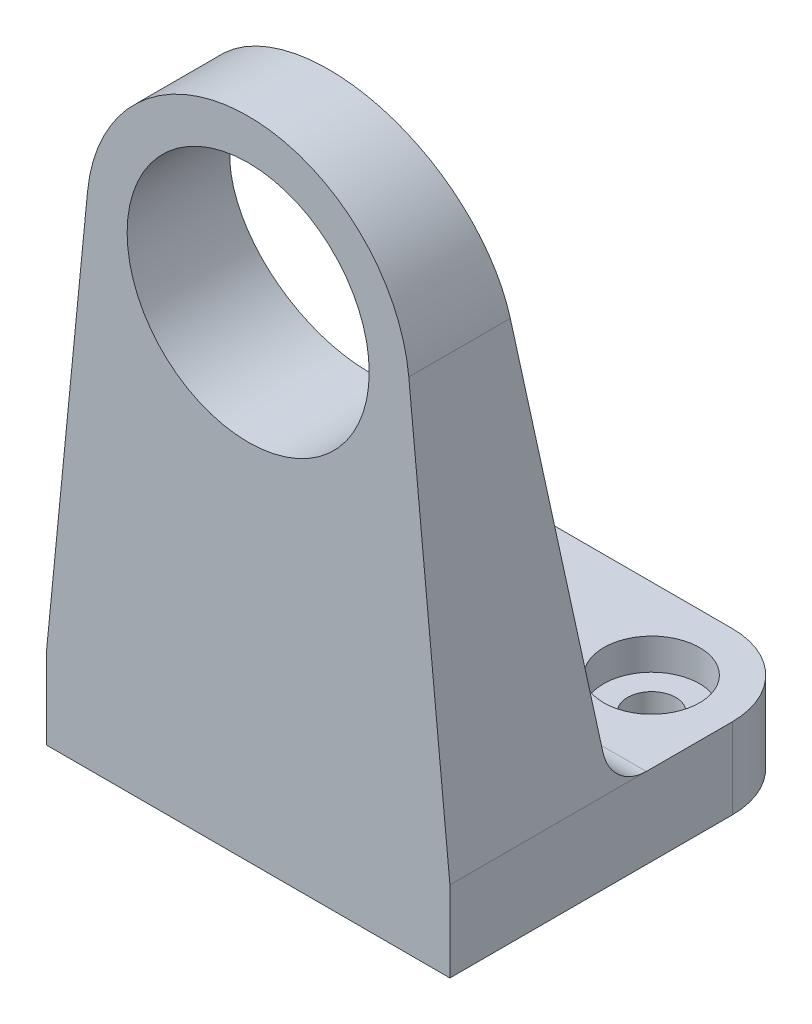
from build123d import *

# Parameters (mm, degrees)
EXTRUDE1_DEPTH                                  = 15.875
SKETCH2_OUTSIDE_W                               = 47.024
SKETCH2_OUTSIDE_H                               = 66.074
CUT_EXTRUDE1_DEPTH                              = 61.40849485
FILLET1_R                                       = 3.175
SKETCH3_R                                       = 9.525
CUT_EXTRUDE2_DEPTH                              = 61.40849485
FILLET2_R                                       = 6.35
CBORE_FOR_6_PAN_HEAD_MACHINE_SCREW1_D           = 3.7973
CBORE_FOR_6_PAN_HEAD_MACHINE_SCREW1_CBORE_D     = 7.54126
CBORE_FOR_6_PAN_HEAD_MACHINE_SCREW1_CBORE_DEPTH = 2.4638


with BuildPart() as part:
    # Sketch1 → Extrude1 (new, symmetric)
    with BuildSketch(Plane(origin=(0, 0, 0), x_dir=(0, 0, -1), z_dir=(1, 0, 0))):
        Polygon((0, 0), (28.575, 0), (28.575, 6.35), (12.7, 6.35), (6.35, 50.8), (0, 50.8), align=None)
    extrude(amount=EXTRUDE1_DEPTH, both=True)

    # Sketch2 outside → Cut-Extrude1 (cut, through all)
    with BuildSketch(Plane.XY):
        with Locations((0, 25.4)):
            Rectangle(SKETCH2_OUTSIDE_W, SKETCH2_OUTSIDE_H)
        with BuildLine():
            Line((15.875, 6.35), (12.639351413, 39.339675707))
            ThreePointArc((12.639351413, 39.339675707), (0, 50.8), (-12.639351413, 39.339675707))
            Line((-12.639351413, 39.339675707), (-15.875, 6.35))
            Line((-15.875, 6.35), (-15.875, 0))
            Line((-15.875, 0), (15.875, 0))
            Line((15.875, 0), (15.875, 6.35))
        make_face(mode=Mode.SUBTRACT)
    extrude(amount=-CUT_EXTRUDE1_DEPTH, mode=Mode.SUBTRACT)

    # Fillet1
    fillet1_edges = [part.edges().sort_by_distance(p)[0] for p in [
        (0, 6.35, -12.7),
    ]]
    fillet(fillet1_edges, radius=FILLET1_R)

    # Sketch3 → Cut-Extrude2 (cut, through all)
    with BuildSketch(Plane.XY):
        with Locations((0, 38.1)):
            Circle(SKETCH3_R)
    extrude(amount=-CUT_EXTRUDE2_DEPTH, mode=Mode.SUBTRACT)

    # Fillet2
    fillet2_edges = [part.edges().sort_by_distance(p)[0] for p in [
        (15.875, 3.175, -28.575),
        (-15.875, 3.175, -28.575),
    ]]
    fillet(fillet2_edges, radius=FILLET2_R)

    # CBORE for _6 Pan Head Machine Screw1 (through all)
    with Locations(Plane(origin=(0, 6.35, 0), x_dir=(-1, 0, 0), z_dir=(0, 1, 0))):
        with Locations((9.525, -22.225), (-9.525, -22.225)):
            CounterBoreHole(CBORE_FOR_6_PAN_HEAD_MACHINE_SCREW1_D / 2, CBORE_FOR_6_PAN_HEAD_MACHINE_SCREW1_CBORE_D / 2, CBORE_FOR_6_PAN_HEAD_MACHINE_SCREW1_CBORE_DEPTH)


solid = part.part
